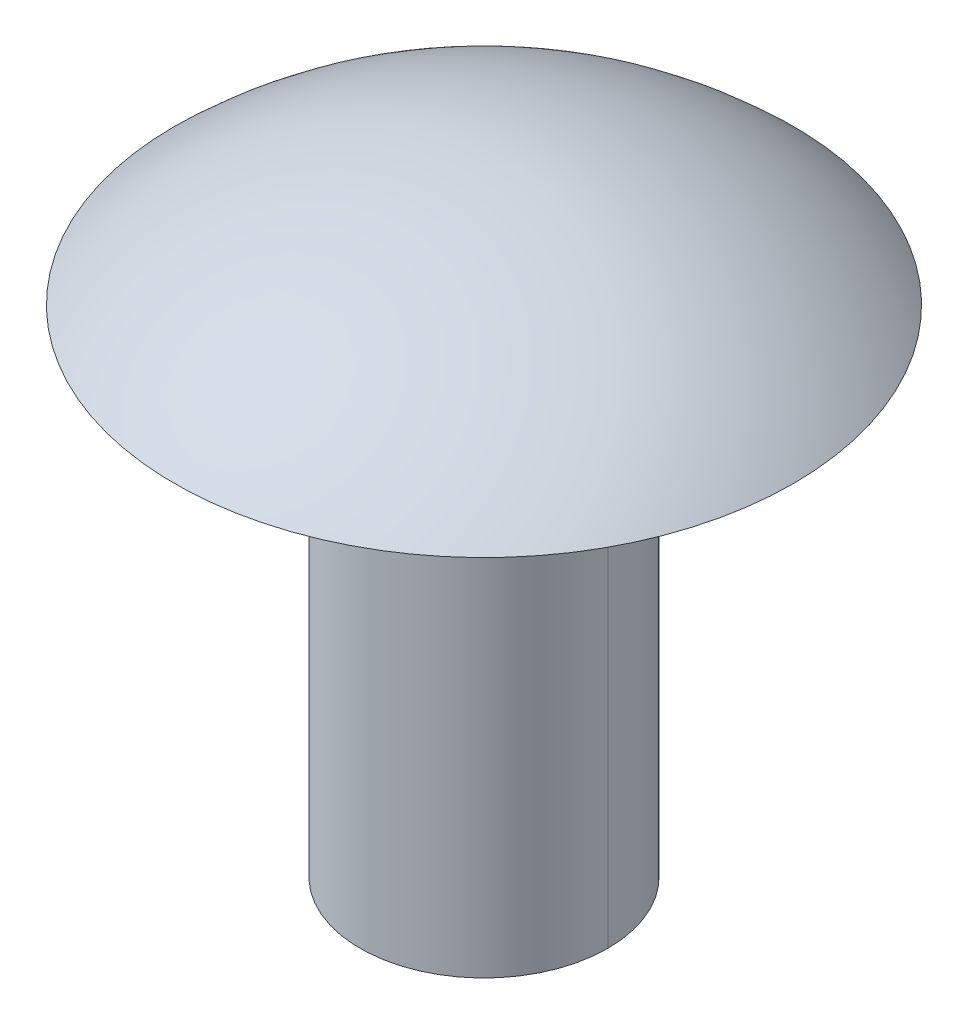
ISO-10303-21;
HEADER;
FILE_DESCRIPTION(('STEP AP214'),'2;1');
FILE_NAME('part.step','',(''),(''),'','','');
FILE_SCHEMA(('AUTOMOTIVE_DESIGN { 1 0 10303 214 1 1 1 1 }'));
ENDSEC;
DATA;
#1=APPLICATION_CONTEXT('core data for automotive mechanical design processes');
#2=APPLICATION_PROTOCOL_DEFINITION('international standard','automotive_design',2000,#1);
#3=PRODUCT_CONTEXT('',#1,'mechanical');
#4=PRODUCT('Part','Part','',(#3));
#5=PRODUCT_RELATED_PRODUCT_CATEGORY('part','',(#4));
#6=PRODUCT_DEFINITION_FORMATION('','',#4);
#7=PRODUCT_DEFINITION_CONTEXT('part definition',#1,'design');
#8=PRODUCT_DEFINITION('design','',#6,#7);
#9=PRODUCT_DEFINITION_SHAPE('','',#8);
#10=(LENGTH_UNIT() NAMED_UNIT(*) SI_UNIT(.MILLI.,.METRE.));
#11=(NAMED_UNIT(*) PLANE_ANGLE_UNIT() SI_UNIT($,.RADIAN.));
#12=(NAMED_UNIT(*) SI_UNIT($,.STERADIAN.) SOLID_ANGLE_UNIT());
#13=UNCERTAINTY_MEASURE_WITH_UNIT(LENGTH_MEASURE(1.E-05),#10,'distance_accuracy_value','');
#14=(GEOMETRIC_REPRESENTATION_CONTEXT(3) GLOBAL_UNCERTAINTY_ASSIGNED_CONTEXT((#13)) GLOBAL_UNIT_ASSIGNED_CONTEXT((#10,
#11,#12)) REPRESENTATION_CONTEXT('',''));
#15=CARTESIAN_POINT('',(0.,0.,0.));
#16=DIRECTION('',(0.,0.,1.));
#17=DIRECTION('',(1.,0.,0.));
#18=AXIS2_PLACEMENT_3D('',#15,#16,#17);
#19=CARTESIAN_POINT('',(0.,-19.05,0.));
#20=DIRECTION('',(0.,1.,0.));
#21=DIRECTION('',(0.,0.,1.));
#22=AXIS2_PLACEMENT_3D('',#19,#20,#21);
#23=PLANE('',#22);
#24=DIRECTION('',(-1.,0.,0.));
#25=VECTOR('',#24,1.);
#26=CARTESIAN_POINT('',(0.,-19.05,0.));
#27=LINE('',#26,#25);
#28=CARTESIAN_POINT('',(4.7625,-19.05,0.));
#29=VERTEX_POINT('',#28);
#30=CARTESIAN_POINT('',(-4.7625,-19.05,0.));
#31=VERTEX_POINT('',#30);
#32=EDGE_CURVE('E11',#29,#31,#27,.T.);
#33=ORIENTED_EDGE('',*,*,#32,.F.);
#34=CARTESIAN_POINT('',(0.,-19.05,0.));
#35=DIRECTION('',(0.,1.,0.));
#36=DIRECTION('',(0.,0.,1.));
#37=AXIS2_PLACEMENT_3D('',#34,#35,#36);
#38=CIRCLE('',#37,4.7625);
#39=EDGE_CURVE('E75',#31,#29,#38,.T.);
#40=ORIENTED_EDGE('',*,*,#39,.F.);
#41=EDGE_LOOP('',(#33,#40));
#42=FACE_BOUND('',#41,.T.);
#43=ADVANCED_FACE('F38',(#42),#23,.F.);
#44=CARTESIAN_POINT('',(0.,0.,0.));
#45=DIRECTION('',(0.,1.,0.));
#46=DIRECTION('',(-1.,0.,0.));
#47=AXIS2_PLACEMENT_3D('',#44,#45,#46);
#48=PLANE('',#47);
#49=DIRECTION('',(-1.,0.,0.));
#50=VECTOR('',#49,1.);
#51=CARTESIAN_POINT('',(0.,0.,0.));
#52=LINE('',#51,#50);
#53=CARTESIAN_POINT('',(11.8999,0.,0.));
#54=VERTEX_POINT('',#53);
#55=CARTESIAN_POINT('',(4.7625,0.,0.));
#56=VERTEX_POINT('',#55);
#57=EDGE_CURVE('E48',#54,#56,#52,.T.);
#58=ORIENTED_EDGE('',*,*,#57,.F.);
#59=CARTESIAN_POINT('',(0.,0.,0.));
#60=DIRECTION('',(0.,1.,0.));
#61=DIRECTION('',(-1.,0.,0.));
#62=AXIS2_PLACEMENT_3D('',#59,#60,#61);
#63=CIRCLE('',#62,11.8999);
#64=CARTESIAN_POINT('',(-11.8999,0.,0.));
#65=VERTEX_POINT('',#64);
#66=EDGE_CURVE('E95',#65,#54,#63,.T.);
#67=ORIENTED_EDGE('',*,*,#66,.F.);
#68=CARTESIAN_POINT('',(-4.7625,0.,0.));
#69=VERTEX_POINT('',#68);
#70=EDGE_CURVE('E61',#69,#65,#52,.T.);
#71=ORIENTED_EDGE('',*,*,#70,.F.);
#72=CARTESIAN_POINT('',(0.,0.,0.));
#73=DIRECTION('',(0.,1.,0.));
#74=DIRECTION('',(0.,0.,1.));
#75=AXIS2_PLACEMENT_3D('',#72,#73,#74);
#76=CIRCLE('',#75,4.7625);
#77=EDGE_CURVE('E97',#69,#56,#76,.T.);
#78=ORIENTED_EDGE('',*,*,#77,.T.);
#79=EDGE_LOOP('',(#58,#67,#71,#78));
#80=FACE_BOUND('',#79,.T.);
#81=ADVANCED_FACE('F117',(#80),#48,.F.);
#82=CARTESIAN_POINT('',(0.,-19.05,0.));
#83=DIRECTION('',(0.,1.,0.));
#84=DIRECTION('',(0.,0.,1.));
#85=AXIS2_PLACEMENT_3D('',#82,#83,#84);
#86=CYLINDRICAL_SURFACE('',#85,4.7625);
#87=ORIENTED_EDGE('',*,*,#77,.F.);
#88=DIRECTION('',(0.,1.,0.));
#89=VECTOR('',#88,1.);
#90=CARTESIAN_POINT('',(-4.7625,-19.05,0.));
#91=LINE('',#90,#89);
#92=EDGE_CURVE('E89',#69,#31,#91,.F.);
#93=ORIENTED_EDGE('',*,*,#92,.T.);
#94=ORIENTED_EDGE('',*,*,#39,.T.);
#95=DIRECTION('',(0.,1.,0.));
#96=VECTOR('',#95,1.);
#97=CARTESIAN_POINT('',(4.7625,-19.05,0.));
#98=LINE('',#97,#96);
#99=EDGE_CURVE('E42',#29,#56,#98,.T.);
#100=ORIENTED_EDGE('',*,*,#99,.T.);
#101=EDGE_LOOP('',(#87,#93,#94,#100));
#102=FACE_BOUND('',#101,.T.);
#103=ADVANCED_FACE('F90',(#102),#86,.T.);
#104=ORIENTED_EDGE('',*,*,#92,.F.);
#105=EDGE_CURVE('E85',#56,#69,#76,.T.);
#106=ORIENTED_EDGE('',*,*,#105,.F.);
#107=ORIENTED_EDGE('',*,*,#99,.F.);
#108=EDGE_CURVE('E84',#29,#31,#38,.T.);
#109=ORIENTED_EDGE('',*,*,#108,.T.);
#110=EDGE_LOOP('',(#104,#106,#107,#109));
#111=FACE_BOUND('',#110,.T.);
#112=ADVANCED_FACE('F40',(#111),#86,.T.);
#113=ORIENTED_EDGE('',*,*,#108,.F.);
#114=ORIENTED_EDGE('',*,*,#32,.T.);
#115=EDGE_LOOP('',(#113,#114));
#116=FACE_BOUND('',#115,.T.);
#117=ADVANCED_FACE('F92',(#116),#23,.F.);
#118=CARTESIAN_POINT('',(0.,-12.5317929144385,0.));
#119=DIRECTION('',(0.,1.,0.));
#120=DIRECTION('',(1.,0.,0.));
#121=AXIS2_PLACEMENT_3D('',#118,#119,#120);
#122=SPHERICAL_SURFACE('',#121,17.2815929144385);
#123=ORIENTED_EDGE('',*,*,#66,.T.);
#124=EDGE_CURVE('E113',#54,#65,#63,.T.);
#125=ORIENTED_EDGE('',*,*,#124,.T.);
#126=EDGE_LOOP('',(#123,#125));
#127=FACE_BOUND('',#126,.T.);
#128=ADVANCED_FACE('F116',(#127),#122,.T.);
#129=ORIENTED_EDGE('',*,*,#124,.F.);
#130=ORIENTED_EDGE('',*,*,#57,.T.);
#131=ORIENTED_EDGE('',*,*,#105,.T.);
#132=ORIENTED_EDGE('',*,*,#70,.T.);
#133=EDGE_LOOP('',(#129,#130,#131,#132));
#134=FACE_BOUND('',#133,.T.);
#135=ADVANCED_FACE('F112',(#134),#48,.F.);
#136=CLOSED_SHELL('',(#43,#81,#103,#112,#117,#128,#135));
#137=MANIFOLD_SOLID_BREP('B2',#136);
#138=ADVANCED_BREP_SHAPE_REPRESENTATION('',(#18,#137),#14);
#139=SHAPE_DEFINITION_REPRESENTATION(#9,#138);
ENDSEC;
END-ISO-10303-21;
